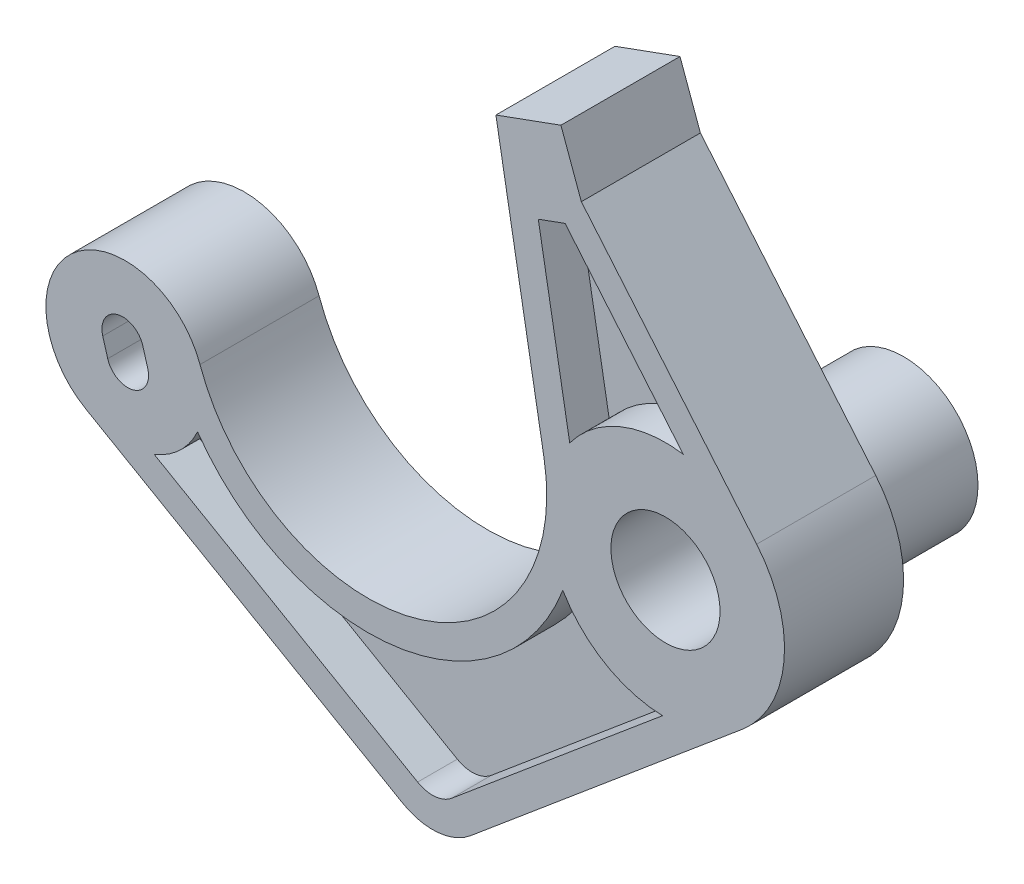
ISO-10303-21;
HEADER;
FILE_DESCRIPTION(('STEP AP214'),'2;1');
FILE_NAME('part.step','',(''),(''),'','','');
FILE_SCHEMA(('AUTOMOTIVE_DESIGN { 1 0 10303 214 1 1 1 1 }'));
ENDSEC;
DATA;
#1=APPLICATION_CONTEXT('core data for automotive mechanical design processes');
#2=APPLICATION_PROTOCOL_DEFINITION('international standard','automotive_design',2000,#1);
#3=PRODUCT_CONTEXT('',#1,'mechanical');
#4=PRODUCT('Part','Part','',(#3));
#5=PRODUCT_RELATED_PRODUCT_CATEGORY('part','',(#4));
#6=PRODUCT_DEFINITION_FORMATION('','',#4);
#7=PRODUCT_DEFINITION_CONTEXT('part definition',#1,'design');
#8=PRODUCT_DEFINITION('design','',#6,#7);
#9=PRODUCT_DEFINITION_SHAPE('','',#8);
#10=(LENGTH_UNIT() NAMED_UNIT(*) SI_UNIT(.MILLI.,.METRE.));
#11=(NAMED_UNIT(*) PLANE_ANGLE_UNIT() SI_UNIT($,.RADIAN.));
#12=(NAMED_UNIT(*) SI_UNIT($,.STERADIAN.) SOLID_ANGLE_UNIT());
#13=UNCERTAINTY_MEASURE_WITH_UNIT(LENGTH_MEASURE(1.E-05),#10,'distance_accuracy_value','');
#14=(GEOMETRIC_REPRESENTATION_CONTEXT(3) GLOBAL_UNCERTAINTY_ASSIGNED_CONTEXT((#13)) GLOBAL_UNIT_ASSIGNED_CONTEXT((#10,
#11,#12)) REPRESENTATION_CONTEXT('',''));
#15=CARTESIAN_POINT('',(0.,0.,0.));
#16=DIRECTION('',(0.,0.,1.));
#17=DIRECTION('',(1.,0.,0.));
#18=AXIS2_PLACEMENT_3D('',#15,#16,#17);
#19=CARTESIAN_POINT('',(27.2255151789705,3.67384921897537,0.));
#20=DIRECTION('',(0.,0.,1.));
#21=DIRECTION('',(1.,0.,0.));
#22=AXIS2_PLACEMENT_3D('',#19,#20,#21);
#23=PLANE('',#22);
#24=DIRECTION('',(0.766044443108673,0.64278760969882,0.));
#25=VECTOR('',#24,1.);
#26=CARTESIAN_POINT('',(17.4125616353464,-12.3926402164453,0.));
#27=LINE('',#26,#25);
#28=CARTESIAN_POINT('',(17.4125616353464,-12.3926402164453,0.));
#29=VERTEX_POINT('',#28);
#30=CARTESIAN_POINT('',(31.0822408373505,-0.92241743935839,0.));
#31=VERTEX_POINT('',#30);
#32=EDGE_CURVE('E519',#29,#31,#27,.T.);
#33=ORIENTED_EDGE('',*,*,#32,.F.);
#34=CARTESIAN_POINT('',(15.4841988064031,-10.0945068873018,0.));
#35=DIRECTION('',(0.,0.,1.));
#36=DIRECTION('',(1.,0.,0.));
#37=AXIS2_PLACEMENT_3D('',#34,#35,#36);
#38=CIRCLE('',#37,2.9999999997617);
#39=CARTESIAN_POINT('',(13.9841988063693,-12.6925830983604,0.));
#40=VERTEX_POINT('',#39);
#41=EDGE_CURVE('E598',#40,#29,#38,.T.);
#42=ORIENTED_EDGE('',*,*,#41,.F.);
#43=DIRECTION('',(0.866025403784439,-0.5,0.));
#44=VECTOR('',#43,1.);
#45=CARTESIAN_POINT('',(-1.99999999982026,-3.46410161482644,0.));
#46=LINE('',#45,#44);
#47=CARTESIAN_POINT('',(-1.99999999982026,-3.46410161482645,0.));
#48=VERTEX_POINT('',#47);
#49=EDGE_CURVE('E653',#48,#40,#46,.T.);
#50=ORIENTED_EDGE('',*,*,#49,.F.);
#51=CARTESIAN_POINT('',(0.,0.,0.));
#52=DIRECTION('',(0.,0.,1.));
#53=DIRECTION('',(1.,0.,0.));
#54=AXIS2_PLACEMENT_3D('',#51,#52,#53);
#55=CIRCLE('',#54,3.99999999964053);
#56=CARTESIAN_POINT('',(3.76673461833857,1.34599788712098,0.));
#57=VERTEX_POINT('',#56);
#58=EDGE_CURVE('E650',#57,#48,#55,.T.);
#59=ORIENTED_EDGE('',*,*,#58,.F.);
#60=CARTESIAN_POINT('',(12.2418875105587,4.37449313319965,0.));
#61=DIRECTION('',(0.,0.,1.));
#62=DIRECTION('',(1.,0.,0.));
#63=AXIS2_PLACEMENT_3D('',#60,#61,#62);
#64=CIRCLE('',#63,9.00000000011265);
#65=CARTESIAN_POINT('',(21.1051572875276,5.93732673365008,0.));
#66=VERTEX_POINT('',#65);
#67=EDGE_CURVE('E646',#57,#66,#64,.T.);
#68=ORIENTED_EDGE('',*,*,#67,.T.);
#69=DIRECTION('',(0.173648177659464,-0.984807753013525,0.));
#70=VECTOR('',#69,1.);
#71=CARTESIAN_POINT('',(18.6797125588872,19.6927073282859,0.));
#72=LINE('',#71,#70);
#73=CARTESIAN_POINT('',(18.6797125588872,19.6927073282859,0.));
#74=VERTEX_POINT('',#73);
#75=EDGE_CURVE('E642',#74,#66,#72,.T.);
#76=ORIENTED_EDGE('',*,*,#75,.F.);
#77=DIRECTION('',(-0.939692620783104,-0.342020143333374,0.));
#78=VECTOR('',#77,1.);
#79=CARTESIAN_POINT('',(21.9571834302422,20.8856091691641,0.));
#80=LINE('',#79,#78);
#81=CARTESIAN_POINT('',(21.9571834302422,20.8856091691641,0.));
#82=VERTEX_POINT('',#81);
#83=EDGE_CURVE('E639',#82,#74,#80,.T.);
#84=ORIENTED_EDGE('',*,*,#83,.F.);
#85=DIRECTION('',(-0.342020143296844,0.9396926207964,0.));
#86=VECTOR('',#85,1.);
#87=CARTESIAN_POINT('',(22.9849132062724,18.0619448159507,0.));
#88=LINE('',#87,#86);
#89=CARTESIAN_POINT('',(22.9849132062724,18.0619448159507,0.));
#90=VERTEX_POINT('',#89);
#91=EDGE_CURVE('E636',#90,#82,#88,.T.);
#92=ORIENTED_EDGE('',*,*,#91,.F.);
#93=DIRECTION('',(-0.642787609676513,0.766044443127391,0.));
#94=VECTOR('',#93,1.);
#95=CARTESIAN_POINT('',(31.8217818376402,7.53057487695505,0.));
#96=LINE('',#95,#94);
#97=CARTESIAN_POINT('',(31.8217818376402,7.53057487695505,0.));
#98=VERTEX_POINT('',#97);
#99=EDGE_CURVE('E633',#98,#90,#96,.T.);
#100=ORIENTED_EDGE('',*,*,#99,.F.);
#101=CARTESIAN_POINT('',(27.2255151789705,3.67384921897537,0.));
#102=DIRECTION('',(0.,0.,1.));
#103=DIRECTION('',(1.,0.,0.));
#104=AXIS2_PLACEMENT_3D('',#101,#102,#103);
#105=CIRCLE('',#104,5.99999999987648);
#106=EDGE_CURVE('E630',#31,#98,#105,.T.);
#107=ORIENTED_EDGE('',*,*,#106,.F.);
#108=EDGE_LOOP('',(#33,#42,#50,#59,#68,#76,#84,#92,#100,#107));
#109=FACE_BOUND('',#108,.T.);
#110=DIRECTION('',(-0.766044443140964,-0.642787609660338,0.));
#111=VECTOR('',#110,1.);
#112=CARTESIAN_POINT('',(16.44838022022,-11.2435735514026,0.));
#113=LINE('',#112,#111);
#114=CARTESIAN_POINT('',(27.0779147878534,-2.32433501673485,0.));
#115=VERTEX_POINT('',#114);
#116=CARTESIAN_POINT('',(16.44838022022,-11.2435735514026,0.));
#117=VERTEX_POINT('',#116);
#118=EDGE_CURVE('E557',#115,#117,#113,.T.);
#119=ORIENTED_EDGE('',*,*,#118,.F.);
#120=CARTESIAN_POINT('',(27.2255151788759,3.67384921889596,0.));
#121=DIRECTION('',(0.,0.,1.));
#122=DIRECTION('',(-1.,0.,0.));
#123=AXIS2_PLACEMENT_3D('',#120,#121,#122);
#124=CIRCLE('',#123,6.);
#125=CARTESIAN_POINT('',(22.052856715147,0.633519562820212,0.));
#126=VERTEX_POINT('',#125);
#127=EDGE_CURVE('E409',#126,#115,#124,.T.);
#128=ORIENTED_EDGE('',*,*,#127,.F.);
#129=CARTESIAN_POINT('',(12.2418875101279,4.37449313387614,0.));
#130=DIRECTION('',(0.,0.,1.));
#131=DIRECTION('',(-1.,0.,0.));
#132=AXIS2_PLACEMENT_3D('',#129,#130,#131);
#133=CIRCLE('',#132,10.5000000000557);
#134=CARTESIAN_POINT('',(3.64317058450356,-1.65145635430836,0.));
#135=VERTEX_POINT('',#134);
#136=EDGE_CURVE('E534',#135,#126,#133,.T.);
#137=ORIENTED_EDGE('',*,*,#136,.F.);
#138=CARTESIAN_POINT('',(2.60735877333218E-10,1.21261334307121E-09,0.));
#139=DIRECTION('',(0.,0.,1.));
#140=DIRECTION('',(-1.,0.,0.));
#141=AXIS2_PLACEMENT_3D('',#138,#139,#140);
#142=CIRCLE('',#141,4.00000000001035);
#143=CARTESIAN_POINT('',(1.45416345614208,-3.72631300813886,0.));
#144=VERTEX_POINT('',#143);
#145=EDGE_CURVE('E569',#144,#135,#142,.T.);
#146=ORIENTED_EDGE('',*,*,#145,.F.);
#147=DIRECTION('',(-0.866025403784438,0.500000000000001,0.));
#148=VECTOR('',#147,1.);
#149=CARTESIAN_POINT('',(1.45416345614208,-3.72631300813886,0.));
#150=LINE('',#149,#148);
#151=CARTESIAN_POINT('',(14.7341988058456,-11.393544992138,0.));
#152=VERTEX_POINT('',#151);
#153=EDGE_CURVE('E565',#152,#144,#150,.T.);
#154=ORIENTED_EDGE('',*,*,#153,.F.);
#155=CARTESIAN_POINT('',(15.4841988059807,-10.0945068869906,0.));
#156=DIRECTION('',(0.,0.,-1.));
#157=DIRECTION('',(-1.,0.,0.));
#158=AXIS2_PLACEMENT_3D('',#155,#156,#157);
#159=CIRCLE('',#158,1.49999999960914);
#160=EDGE_CURVE('E561',#117,#152,#159,.T.);
#161=ORIENTED_EDGE('',*,*,#160,.F.);
#162=EDGE_LOOP('',(#119,#128,#137,#146,#154,#161));
#163=FACE_BOUND('',#162,.T.);
#164=DIRECTION('',(0.642787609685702,-0.766044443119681,0.));
#165=VECTOR('',#164,1.);
#166=CARTESIAN_POINT('',(28.1217309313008,9.60653809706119,0.));
#167=LINE('',#166,#165);
#168=CARTESIAN_POINT('',(22.1656148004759,16.7047608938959,0.));
#169=VERTEX_POINT('',#168);
#170=CARTESIAN_POINT('',(28.1217309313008,9.60653809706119,0.));
#171=VERTEX_POINT('',#170);
#172=EDGE_CURVE('E504',#169,#171,#167,.T.);
#173=ORIENTED_EDGE('',*,*,#172,.F.);
#174=DIRECTION('',(0.939692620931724,0.342020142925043,0.));
#175=VECTOR('',#174,1.);
#176=CARTESIAN_POINT('',(22.1656148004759,16.7047608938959,0.));
#177=LINE('',#176,#175);
#178=CARTESIAN_POINT('',(20.8163038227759,16.213651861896,0.));
#179=VERTEX_POINT('',#178);
#180=EDGE_CURVE('E501',#179,#169,#177,.T.);
#181=ORIENTED_EDGE('',*,*,#180,.F.);
#182=DIRECTION('',(-0.173648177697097,0.984807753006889,0.));
#183=VECTOR('',#182,1.);
#184=CARTESIAN_POINT('',(20.8163038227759,16.213651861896,0.));
#185=LINE('',#184,#183);
#186=CARTESIAN_POINT('',(22.3989308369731,7.23812805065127,0.));
#187=VERTEX_POINT('',#186);
#188=EDGE_CURVE('E488',#187,#179,#185,.T.);
#189=ORIENTED_EDGE('',*,*,#188,.F.);
#190=CARTESIAN_POINT('',(27.2255151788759,3.67384921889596,0.));
#191=DIRECTION('',(0.,0.,1.));
#192=DIRECTION('',(-1.,0.,0.));
#193=AXIS2_PLACEMENT_3D('',#190,#191,#192);
#194=CIRCLE('',#193,6.);
#195=EDGE_CURVE('E509',#171,#187,#194,.T.);
#196=ORIENTED_EDGE('',*,*,#195,.F.);
#197=EDGE_LOOP('',(#173,#181,#189,#196));
#198=FACE_BOUND('',#197,.T.);
#199=CARTESIAN_POINT('',(0.125158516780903,-0.432244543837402,0.));
#200=DIRECTION('',(0.,0.,1.));
#201=DIRECTION('',(1.,0.,0.));
#202=AXIS2_PLACEMENT_3D('',#199,#200,#201);
#203=CIRCLE('',#202,1.05);
#204=CARTESIAN_POINT('',(-0.883412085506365,-0.724281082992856,0.));
#205=VERTEX_POINT('',#204);
#206=CARTESIAN_POINT('',(1.13372911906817,-0.140208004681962,0.));
#207=VERTEX_POINT('',#206);
#208=EDGE_CURVE('E703',#205,#207,#203,.T.);
#209=ORIENTED_EDGE('',*,*,#208,.T.);
#210=DIRECTION('',(-0.278130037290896,0.960543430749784,0.));
#211=VECTOR('',#210,1.);
#212=CARTESIAN_POINT('',(2.13314541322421,-3.59176888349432,0.));
#213=LINE('',#212,#211);
#214=CARTESIAN_POINT('',(0.883412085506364,0.724281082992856,0.));
#215=VERTEX_POINT('',#214);
#216=EDGE_CURVE('E122',#207,#215,#213,.T.);
#217=ORIENTED_EDGE('',*,*,#216,.T.);
#218=CARTESIAN_POINT('',(-0.125158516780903,0.432244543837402,0.));
#219=DIRECTION('',(0.,0.,1.));
#220=DIRECTION('',(1.,0.,0.));
#221=AXIS2_PLACEMENT_3D('',#218,#219,#220);
#222=CIRCLE('',#221,1.05);
#223=CARTESIAN_POINT('',(-1.13372911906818,0.140208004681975,0.));
#224=VERTEX_POINT('',#223);
#225=EDGE_CURVE('E699',#215,#224,#222,.T.);
#226=ORIENTED_EDGE('',*,*,#225,.T.);
#227=DIRECTION('',(0.278130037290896,-0.960543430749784,0.));
#228=VECTOR('',#227,1.);
#229=CARTESIAN_POINT('',(0.116004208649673,-4.1758419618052,0.));
#230=LINE('',#229,#228);
#231=EDGE_CURVE('E695',#224,#205,#230,.T.);
#232=ORIENTED_EDGE('',*,*,#231,.T.);
#233=EDGE_LOOP('',(#209,#217,#226,#232));
#234=FACE_BOUND('',#233,.T.);
#235=CARTESIAN_POINT('',(27.2255151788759,3.67384921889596,0.));
#236=DIRECTION('',(0.,0.,1.));
#237=DIRECTION('',(1.,0.,0.));
#238=AXIS2_PLACEMENT_3D('',#235,#236,#237);
#239=CIRCLE('',#238,3.75);
#240=CARTESIAN_POINT('',(30.9755151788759,3.67384921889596,0.));
#241=VERTEX_POINT('',#240);
#242=EDGE_CURVE('E13',#241,#241,#239,.F.);
#243=ORIENTED_EDGE('',*,*,#242,.F.);
#244=EDGE_LOOP('',(#243));
#245=FACE_BOUND('',#244,.T.);
#246=ADVANCED_FACE('F113',(#109,#163,#198,#234,#245),#23,.F.);
#247=CARTESIAN_POINT('',(27.2255151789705,3.67384921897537,6.));
#248=DIRECTION('',(0.,0.,1.));
#249=DIRECTION('',(1.,0.,0.));
#250=AXIS2_PLACEMENT_3D('',#247,#248,#249);
#251=PLANE('',#250);
#252=CARTESIAN_POINT('',(27.2255151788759,3.67384921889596,6.));
#253=DIRECTION('',(0.,0.,1.));
#254=DIRECTION('',(1.,0.,0.));
#255=AXIS2_PLACEMENT_3D('',#252,#253,#254);
#256=CIRCLE('',#255,2.75);
#257=CARTESIAN_POINT('',(29.9755151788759,3.67384921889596,6.));
#258=VERTEX_POINT('',#257);
#259=EDGE_CURVE('E362',#258,#258,#256,.T.);
#260=ORIENTED_EDGE('',*,*,#259,.F.);
#261=EDGE_LOOP('',(#260));
#262=FACE_BOUND('',#261,.T.);
#263=CARTESIAN_POINT('',(27.2255151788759,3.67384921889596,6.));
#264=DIRECTION('',(0.,0.,-1.));
#265=DIRECTION('',(1.,0.,0.));
#266=AXIS2_PLACEMENT_3D('',#263,#264,#265);
#267=CIRCLE('',#266,6.);
#268=CARTESIAN_POINT('',(22.3989308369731,7.23812805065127,6.));
#269=VERTEX_POINT('',#268);
#270=CARTESIAN_POINT('',(28.1217309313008,9.60653809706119,6.));
#271=VERTEX_POINT('',#270);
#272=EDGE_CURVE('E391',#269,#271,#267,.T.);
#273=ORIENTED_EDGE('',*,*,#272,.F.);
#274=DIRECTION('',(0.173648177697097,-0.984807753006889,0.));
#275=VECTOR('',#274,1.);
#276=CARTESIAN_POINT('',(20.8163038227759,16.213651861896,6.));
#277=LINE('',#276,#275);
#278=CARTESIAN_POINT('',(20.8163038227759,16.213651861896,6.));
#279=VERTEX_POINT('',#278);
#280=EDGE_CURVE('E378',#279,#269,#277,.T.);
#281=ORIENTED_EDGE('',*,*,#280,.F.);
#282=DIRECTION('',(-0.939692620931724,-0.342020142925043,0.));
#283=VECTOR('',#282,1.);
#284=CARTESIAN_POINT('',(22.1656148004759,16.7047608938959,6.));
#285=LINE('',#284,#283);
#286=CARTESIAN_POINT('',(22.1656148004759,16.7047608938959,6.));
#287=VERTEX_POINT('',#286);
#288=EDGE_CURVE('E399',#287,#279,#285,.T.);
#289=ORIENTED_EDGE('',*,*,#288,.F.);
#290=DIRECTION('',(-0.642787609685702,0.766044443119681,0.));
#291=VECTOR('',#290,1.);
#292=CARTESIAN_POINT('',(28.1217309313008,9.60653809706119,6.));
#293=LINE('',#292,#291);
#294=EDGE_CURVE('E394',#271,#287,#293,.T.);
#295=ORIENTED_EDGE('',*,*,#294,.F.);
#296=EDGE_LOOP('',(#273,#281,#289,#295));
#297=FACE_BOUND('',#296,.T.);
#298=CARTESIAN_POINT('',(15.4841988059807,-10.0945068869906,6.));
#299=DIRECTION('',(0.,0.,1.));
#300=DIRECTION('',(1.,0.,0.));
#301=AXIS2_PLACEMENT_3D('',#298,#299,#300);
#302=CIRCLE('',#301,1.49999999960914);
#303=CARTESIAN_POINT('',(14.7341988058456,-11.393544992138,6.));
#304=VERTEX_POINT('',#303);
#305=CARTESIAN_POINT('',(16.44838022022,-11.2435735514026,6.));
#306=VERTEX_POINT('',#305);
#307=EDGE_CURVE('E372',#304,#306,#302,.T.);
#308=ORIENTED_EDGE('',*,*,#307,.F.);
#309=DIRECTION('',(0.866025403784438,-0.500000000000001,0.));
#310=VECTOR('',#309,1.);
#311=CARTESIAN_POINT('',(1.45416345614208,-3.72631300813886,6.));
#312=LINE('',#311,#310);
#313=CARTESIAN_POINT('',(1.45416345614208,-3.72631300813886,6.));
#314=VERTEX_POINT('',#313);
#315=EDGE_CURVE('E424',#314,#304,#312,.T.);
#316=ORIENTED_EDGE('',*,*,#315,.F.);
#317=CARTESIAN_POINT('',(2.60735877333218E-10,1.21261334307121E-09,6.));
#318=DIRECTION('',(0.,0.,-1.));
#319=DIRECTION('',(1.,0.,0.));
#320=AXIS2_PLACEMENT_3D('',#317,#318,#319);
#321=CIRCLE('',#320,4.00000000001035);
#322=CARTESIAN_POINT('',(3.64317058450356,-1.65145635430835,6.));
#323=VERTEX_POINT('',#322);
#324=EDGE_CURVE('E459',#323,#314,#321,.T.);
#325=ORIENTED_EDGE('',*,*,#324,.F.);
#326=CARTESIAN_POINT('',(12.2418875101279,4.37449313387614,6.));
#327=DIRECTION('',(0.,0.,-1.));
#328=DIRECTION('',(1.,0.,0.));
#329=AXIS2_PLACEMENT_3D('',#326,#327,#328);
#330=CIRCLE('',#329,10.5000000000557);
#331=CARTESIAN_POINT('',(22.052856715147,0.633519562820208,6.));
#332=VERTEX_POINT('',#331);
#333=EDGE_CURVE('E455',#332,#323,#330,.T.);
#334=ORIENTED_EDGE('',*,*,#333,.F.);
#335=CARTESIAN_POINT('',(27.2255151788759,3.67384921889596,6.));
#336=DIRECTION('',(0.,0.,-1.));
#337=DIRECTION('',(1.,0.,0.));
#338=AXIS2_PLACEMENT_3D('',#335,#336,#337);
#339=CIRCLE('',#338,6.);
#340=CARTESIAN_POINT('',(27.0779147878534,-2.32433501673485,6.));
#341=VERTEX_POINT('',#340);
#342=EDGE_CURVE('E451',#341,#332,#339,.T.);
#343=ORIENTED_EDGE('',*,*,#342,.F.);
#344=DIRECTION('',(0.766044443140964,0.642787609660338,0.));
#345=VECTOR('',#344,1.);
#346=CARTESIAN_POINT('',(16.44838022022,-11.2435735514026,6.));
#347=LINE('',#346,#345);
#348=EDGE_CURVE('E447',#306,#341,#347,.T.);
#349=ORIENTED_EDGE('',*,*,#348,.F.);
#350=EDGE_LOOP('',(#308,#316,#325,#334,#343,#349));
#351=FACE_BOUND('',#350,.T.);
#352=DIRECTION('',(0.766044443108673,0.64278760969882,0.));
#353=VECTOR('',#352,1.);
#354=CARTESIAN_POINT('',(17.4125616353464,-12.3926402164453,6.));
#355=LINE('',#354,#353);
#356=CARTESIAN_POINT('',(17.4125616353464,-12.3926402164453,6.));
#357=VERTEX_POINT('',#356);
#358=CARTESIAN_POINT('',(31.0822408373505,-0.92241743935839,6.));
#359=VERTEX_POINT('',#358);
#360=EDGE_CURVE('E593',#357,#359,#355,.T.);
#361=ORIENTED_EDGE('',*,*,#360,.T.);
#362=CARTESIAN_POINT('',(27.2255151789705,3.67384921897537,6.));
#363=DIRECTION('',(0.,0.,1.));
#364=DIRECTION('',(1.,0.,0.));
#365=AXIS2_PLACEMENT_3D('',#362,#363,#364);
#366=CIRCLE('',#365,5.99999999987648);
#367=CARTESIAN_POINT('',(31.8217818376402,7.53057487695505,6.));
#368=VERTEX_POINT('',#367);
#369=EDGE_CURVE('E597',#359,#368,#366,.T.);
#370=ORIENTED_EDGE('',*,*,#369,.T.);
#371=DIRECTION('',(-0.642787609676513,0.766044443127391,0.));
#372=VECTOR('',#371,1.);
#373=CARTESIAN_POINT('',(31.8217818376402,7.53057487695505,6.));
#374=LINE('',#373,#372);
#375=CARTESIAN_POINT('',(22.9849132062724,18.0619448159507,6.));
#376=VERTEX_POINT('',#375);
#377=EDGE_CURVE('E601',#368,#376,#374,.T.);
#378=ORIENTED_EDGE('',*,*,#377,.T.);
#379=DIRECTION('',(-0.342020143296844,0.9396926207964,0.));
#380=VECTOR('',#379,1.);
#381=CARTESIAN_POINT('',(22.9849132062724,18.0619448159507,6.));
#382=LINE('',#381,#380);
#383=CARTESIAN_POINT('',(21.9571834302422,20.8856091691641,6.));
#384=VERTEX_POINT('',#383);
#385=EDGE_CURVE('E604',#376,#384,#382,.T.);
#386=ORIENTED_EDGE('',*,*,#385,.T.);
#387=DIRECTION('',(-0.939692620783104,-0.342020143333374,0.));
#388=VECTOR('',#387,1.);
#389=CARTESIAN_POINT('',(21.9571834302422,20.8856091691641,6.));
#390=LINE('',#389,#388);
#391=CARTESIAN_POINT('',(18.6797125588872,19.6927073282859,6.));
#392=VERTEX_POINT('',#391);
#393=EDGE_CURVE('E607',#384,#392,#390,.T.);
#394=ORIENTED_EDGE('',*,*,#393,.T.);
#395=DIRECTION('',(0.173648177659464,-0.984807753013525,0.));
#396=VECTOR('',#395,1.);
#397=CARTESIAN_POINT('',(18.6797125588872,19.6927073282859,6.));
#398=LINE('',#397,#396);
#399=CARTESIAN_POINT('',(21.1051572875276,5.93732673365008,6.));
#400=VERTEX_POINT('',#399);
#401=EDGE_CURVE('E610',#392,#400,#398,.T.);
#402=ORIENTED_EDGE('',*,*,#401,.T.);
#403=CARTESIAN_POINT('',(12.2418875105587,4.37449313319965,6.));
#404=DIRECTION('',(0.,0.,1.));
#405=DIRECTION('',(1.,0.,0.));
#406=AXIS2_PLACEMENT_3D('',#403,#404,#405);
#407=CIRCLE('',#406,9.00000000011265);
#408=CARTESIAN_POINT('',(3.76673461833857,1.34599788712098,6.));
#409=VERTEX_POINT('',#408);
#410=EDGE_CURVE('E613',#409,#400,#407,.T.);
#411=ORIENTED_EDGE('',*,*,#410,.F.);
#412=CARTESIAN_POINT('',(0.,0.,6.));
#413=DIRECTION('',(0.,0.,1.));
#414=DIRECTION('',(1.,0.,0.));
#415=AXIS2_PLACEMENT_3D('',#412,#413,#414);
#416=CIRCLE('',#415,3.99999999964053);
#417=CARTESIAN_POINT('',(-1.99999999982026,-3.46410161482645,6.));
#418=VERTEX_POINT('',#417);
#419=EDGE_CURVE('E617',#409,#418,#416,.T.);
#420=ORIENTED_EDGE('',*,*,#419,.T.);
#421=DIRECTION('',(0.866025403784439,-0.5,0.));
#422=VECTOR('',#421,1.);
#423=CARTESIAN_POINT('',(-1.99999999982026,-3.46410161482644,6.));
#424=LINE('',#423,#422);
#425=CARTESIAN_POINT('',(13.9841988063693,-12.6925830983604,6.));
#426=VERTEX_POINT('',#425);
#427=EDGE_CURVE('E620',#418,#426,#424,.T.);
#428=ORIENTED_EDGE('',*,*,#427,.T.);
#429=CARTESIAN_POINT('',(15.4841988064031,-10.0945068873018,6.));
#430=DIRECTION('',(0.,0.,1.));
#431=DIRECTION('',(1.,0.,0.));
#432=AXIS2_PLACEMENT_3D('',#429,#430,#431);
#433=CIRCLE('',#432,2.9999999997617);
#434=EDGE_CURVE('E623',#426,#357,#433,.T.);
#435=ORIENTED_EDGE('',*,*,#434,.T.);
#436=EDGE_LOOP('',(#361,#370,#378,#386,#394,#402,#411,#420,#428,#435));
#437=FACE_BOUND('',#436,.T.);
#438=CARTESIAN_POINT('',(-0.125158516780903,0.432244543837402,6.));
#439=DIRECTION('',(0.,0.,1.));
#440=DIRECTION('',(1.,0.,0.));
#441=AXIS2_PLACEMENT_3D('',#438,#439,#440);
#442=CIRCLE('',#441,1.05);
#443=CARTESIAN_POINT('',(0.883412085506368,0.724281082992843,6.));
#444=VERTEX_POINT('',#443);
#445=CARTESIAN_POINT('',(-1.13372911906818,0.140208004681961,6.));
#446=VERTEX_POINT('',#445);
#447=EDGE_CURVE('E354',#444,#446,#442,.T.);
#448=ORIENTED_EDGE('',*,*,#447,.F.);
#449=DIRECTION('',(0.278130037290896,-0.960543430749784,0.));
#450=VECTOR('',#449,1.);
#451=CARTESIAN_POINT('',(0.883412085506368,0.724281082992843,6.));
#452=LINE('',#451,#450);
#453=CARTESIAN_POINT('',(1.13372911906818,-0.140208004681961,6.));
#454=VERTEX_POINT('',#453);
#455=EDGE_CURVE('E339',#444,#454,#452,.T.);
#456=ORIENTED_EDGE('',*,*,#455,.T.);
#457=CARTESIAN_POINT('',(0.125158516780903,-0.432244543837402,6.));
#458=DIRECTION('',(0.,0.,1.));
#459=DIRECTION('',(1.,0.,0.));
#460=AXIS2_PLACEMENT_3D('',#457,#458,#459);
#461=CIRCLE('',#460,1.05);
#462=CARTESIAN_POINT('',(-0.883412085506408,-0.724281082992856,6.));
#463=VERTEX_POINT('',#462);
#464=EDGE_CURVE('E345',#463,#454,#461,.T.);
#465=ORIENTED_EDGE('',*,*,#464,.F.);
#466=DIRECTION('',(0.278130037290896,-0.960543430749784,0.));
#467=VECTOR('',#466,1.);
#468=CARTESIAN_POINT('',(-1.13372911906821,0.140208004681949,6.));
#469=LINE('',#468,#467);
#470=EDGE_CURVE('E356',#446,#463,#469,.T.);
#471=ORIENTED_EDGE('',*,*,#470,.F.);
#472=EDGE_LOOP('',(#448,#456,#465,#471));
#473=FACE_BOUND('',#472,.T.);
#474=ADVANCED_FACE('F353',(#262,#297,#351,#437,#473),#251,.T.);
#475=CARTESIAN_POINT('',(17.4125616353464,-12.3926402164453,6.));
#476=DIRECTION('',(-0.642787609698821,0.766044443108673,0.));
#477=DIRECTION('',(-0.766044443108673,-0.642787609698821,0.));
#478=AXIS2_PLACEMENT_3D('',#475,#476,#477);
#479=PLANE('',#478);
#480=ORIENTED_EDGE('',*,*,#32,.T.);
#481=DIRECTION('',(0.,0.,-1.));
#482=VECTOR('',#481,1.);
#483=CARTESIAN_POINT('',(31.0822408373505,-0.92241743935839,6.));
#484=LINE('',#483,#482);
#485=EDGE_CURVE('E691',#359,#31,#484,.T.);
#486=ORIENTED_EDGE('',*,*,#485,.F.);
#487=ORIENTED_EDGE('',*,*,#360,.F.);
#488=DIRECTION('',(0.,0.,-1.));
#489=VECTOR('',#488,1.);
#490=CARTESIAN_POINT('',(17.4125616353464,-12.3926402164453,6.));
#491=LINE('',#490,#489);
#492=EDGE_CURVE('E626',#357,#29,#491,.T.);
#493=ORIENTED_EDGE('',*,*,#492,.T.);
#494=EDGE_LOOP('',(#480,#486,#487,#493));
#495=FACE_BOUND('',#494,.T.);
#496=ADVANCED_FACE('F115',(#495),#479,.F.);
#497=CARTESIAN_POINT('',(27.2255151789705,3.67384921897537,6.));
#498=DIRECTION('',(0.,0.,-1.));
#499=DIRECTION('',(-1.,0.,0.));
#500=AXIS2_PLACEMENT_3D('',#497,#498,#499);
#501=CYLINDRICAL_SURFACE('',#500,5.99999999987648);
#502=ORIENTED_EDGE('',*,*,#106,.T.);
#503=DIRECTION('',(0.,0.,-1.));
#504=VECTOR('',#503,1.);
#505=CARTESIAN_POINT('',(31.8217818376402,7.53057487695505,6.));
#506=LINE('',#505,#504);
#507=EDGE_CURVE('E687',#368,#98,#506,.T.);
#508=ORIENTED_EDGE('',*,*,#507,.F.);
#509=ORIENTED_EDGE('',*,*,#369,.F.);
#510=ORIENTED_EDGE('',*,*,#485,.T.);
#511=EDGE_LOOP('',(#502,#508,#509,#510));
#512=FACE_BOUND('',#511,.T.);
#513=ADVANCED_FACE('F765',(#512),#501,.T.);
#514=CARTESIAN_POINT('',(31.8217818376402,7.53057487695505,6.));
#515=DIRECTION('',(-0.766044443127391,-0.642787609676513,0.));
#516=DIRECTION('',(0.642787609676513,-0.766044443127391,0.));
#517=AXIS2_PLACEMENT_3D('',#514,#515,#516);
#518=PLANE('',#517);
#519=ORIENTED_EDGE('',*,*,#99,.T.);
#520=DIRECTION('',(0.,0.,-1.));
#521=VECTOR('',#520,1.);
#522=CARTESIAN_POINT('',(22.9849132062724,18.0619448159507,6.));
#523=LINE('',#522,#521);
#524=EDGE_CURVE('E683',#376,#90,#523,.T.);
#525=ORIENTED_EDGE('',*,*,#524,.F.);
#526=ORIENTED_EDGE('',*,*,#377,.F.);
#527=ORIENTED_EDGE('',*,*,#507,.T.);
#528=EDGE_LOOP('',(#519,#525,#526,#527));
#529=FACE_BOUND('',#528,.T.);
#530=ADVANCED_FACE('F762',(#529),#518,.F.);
#531=CARTESIAN_POINT('',(22.9849132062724,18.0619448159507,6.));
#532=DIRECTION('',(-0.9396926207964,-0.342020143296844,0.));
#533=DIRECTION('',(0.342020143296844,-0.9396926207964,0.));
#534=AXIS2_PLACEMENT_3D('',#531,#532,#533);
#535=PLANE('',#534);
#536=ORIENTED_EDGE('',*,*,#91,.T.);
#537=DIRECTION('',(0.,0.,-1.));
#538=VECTOR('',#537,1.);
#539=CARTESIAN_POINT('',(21.9571834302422,20.8856091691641,6.));
#540=LINE('',#539,#538);
#541=EDGE_CURVE('E679',#384,#82,#540,.T.);
#542=ORIENTED_EDGE('',*,*,#541,.F.);
#543=ORIENTED_EDGE('',*,*,#385,.F.);
#544=ORIENTED_EDGE('',*,*,#524,.T.);
#545=EDGE_LOOP('',(#536,#542,#543,#544));
#546=FACE_BOUND('',#545,.T.);
#547=ADVANCED_FACE('F758',(#546),#535,.F.);
#548=CARTESIAN_POINT('',(21.9571834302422,20.8856091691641,6.));
#549=DIRECTION('',(0.342020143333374,-0.939692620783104,0.));
#550=DIRECTION('',(0.939692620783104,0.342020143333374,0.));
#551=AXIS2_PLACEMENT_3D('',#548,#549,#550);
#552=PLANE('',#551);
#553=ORIENTED_EDGE('',*,*,#83,.T.);
#554=DIRECTION('',(0.,0.,-1.));
#555=VECTOR('',#554,1.);
#556=CARTESIAN_POINT('',(18.6797125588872,19.6927073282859,6.));
#557=LINE('',#556,#555);
#558=EDGE_CURVE('E675',#392,#74,#557,.T.);
#559=ORIENTED_EDGE('',*,*,#558,.F.);
#560=ORIENTED_EDGE('',*,*,#393,.F.);
#561=ORIENTED_EDGE('',*,*,#541,.T.);
#562=EDGE_LOOP('',(#553,#559,#560,#561));
#563=FACE_BOUND('',#562,.T.);
#564=ADVANCED_FACE('F754',(#563),#552,.F.);
#565=CARTESIAN_POINT('',(18.6797125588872,19.6927073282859,6.));
#566=DIRECTION('',(0.984807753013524,0.173648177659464,0.));
#567=DIRECTION('',(-0.173648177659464,0.984807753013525,0.));
#568=AXIS2_PLACEMENT_3D('',#565,#566,#567);
#569=PLANE('',#568);
#570=ORIENTED_EDGE('',*,*,#75,.T.);
#571=DIRECTION('',(0.,0.,-1.));
#572=VECTOR('',#571,1.);
#573=CARTESIAN_POINT('',(21.1051572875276,5.93732673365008,6.));
#574=LINE('',#573,#572);
#575=EDGE_CURVE('E672',#400,#66,#574,.T.);
#576=ORIENTED_EDGE('',*,*,#575,.F.);
#577=ORIENTED_EDGE('',*,*,#401,.F.);
#578=ORIENTED_EDGE('',*,*,#558,.T.);
#579=EDGE_LOOP('',(#570,#576,#577,#578));
#580=FACE_BOUND('',#579,.T.);
#581=ADVANCED_FACE('F750',(#580),#569,.F.);
#582=CARTESIAN_POINT('',(12.2418875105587,4.37449313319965,6.));
#583=DIRECTION('',(0.,0.,-1.));
#584=DIRECTION('',(-1.,0.,0.));
#585=AXIS2_PLACEMENT_3D('',#582,#583,#584);
#586=CYLINDRICAL_SURFACE('',#585,9.00000000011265);
#587=ORIENTED_EDGE('',*,*,#67,.F.);
#588=DIRECTION('',(0.,0.,-1.));
#589=VECTOR('',#588,1.);
#590=CARTESIAN_POINT('',(3.76673461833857,1.34599788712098,6.));
#591=LINE('',#590,#589);
#592=EDGE_CURVE('E669',#409,#57,#591,.T.);
#593=ORIENTED_EDGE('',*,*,#592,.F.);
#594=ORIENTED_EDGE('',*,*,#410,.T.);
#595=ORIENTED_EDGE('',*,*,#575,.T.);
#596=EDGE_LOOP('',(#587,#593,#594,#595));
#597=FACE_BOUND('',#596,.T.);
#598=ADVANCED_FACE('F746',(#597),#586,.F.);
#599=CARTESIAN_POINT('',(0.,0.,6.));
#600=DIRECTION('',(0.,0.,-1.));
#601=DIRECTION('',(-1.,0.,0.));
#602=AXIS2_PLACEMENT_3D('',#599,#600,#601);
#603=CYLINDRICAL_SURFACE('',#602,3.99999999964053);
#604=ORIENTED_EDGE('',*,*,#58,.T.);
#605=DIRECTION('',(0.,0.,-1.));
#606=VECTOR('',#605,1.);
#607=CARTESIAN_POINT('',(-1.99999999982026,-3.46410161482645,6.));
#608=LINE('',#607,#606);
#609=EDGE_CURVE('E665',#418,#48,#608,.T.);
#610=ORIENTED_EDGE('',*,*,#609,.F.);
#611=ORIENTED_EDGE('',*,*,#419,.F.);
#612=ORIENTED_EDGE('',*,*,#592,.T.);
#613=EDGE_LOOP('',(#604,#610,#611,#612));
#614=FACE_BOUND('',#613,.T.);
#615=ADVANCED_FACE('F742',(#614),#603,.T.);
#616=CARTESIAN_POINT('',(-1.99999999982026,-3.46410161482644,6.));
#617=DIRECTION('',(0.5,0.866025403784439,0.));
#618=DIRECTION('',(-0.866025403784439,0.5,0.));
#619=AXIS2_PLACEMENT_3D('',#616,#617,#618);
#620=PLANE('',#619);
#621=ORIENTED_EDGE('',*,*,#49,.T.);
#622=DIRECTION('',(0.,0.,-1.));
#623=VECTOR('',#622,1.);
#624=CARTESIAN_POINT('',(13.9841988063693,-12.6925830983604,6.));
#625=LINE('',#624,#623);
#626=EDGE_CURVE('E661',#426,#40,#625,.T.);
#627=ORIENTED_EDGE('',*,*,#626,.F.);
#628=ORIENTED_EDGE('',*,*,#427,.F.);
#629=ORIENTED_EDGE('',*,*,#609,.T.);
#630=EDGE_LOOP('',(#621,#627,#628,#629));
#631=FACE_BOUND('',#630,.T.);
#632=ADVANCED_FACE('F738',(#631),#620,.F.);
#633=CARTESIAN_POINT('',(15.4841988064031,-10.0945068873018,6.));
#634=DIRECTION('',(0.,0.,-1.));
#635=DIRECTION('',(-1.,0.,0.));
#636=AXIS2_PLACEMENT_3D('',#633,#634,#635);
#637=CYLINDRICAL_SURFACE('',#636,2.9999999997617);
#638=ORIENTED_EDGE('',*,*,#41,.T.);
#639=ORIENTED_EDGE('',*,*,#492,.F.);
#640=ORIENTED_EDGE('',*,*,#434,.F.);
#641=ORIENTED_EDGE('',*,*,#626,.T.);
#642=EDGE_LOOP('',(#638,#639,#640,#641));
#643=FACE_BOUND('',#642,.T.);
#644=ADVANCED_FACE('F734',(#643),#637,.T.);
#645=CARTESIAN_POINT('',(27.2255151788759,3.67384921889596,2.));
#646=DIRECTION('',(0.,0.,-1.));
#647=DIRECTION('',(-1.,0.,0.));
#648=AXIS2_PLACEMENT_3D('',#645,#646,#647);
#649=CYLINDRICAL_SURFACE('',#648,6.);
#650=ORIENTED_EDGE('',*,*,#127,.T.);
#651=DIRECTION('',(0.,0.,-1.));
#652=VECTOR('',#651,1.);
#653=CARTESIAN_POINT('',(27.0779147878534,-2.32433501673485,2.));
#654=LINE('',#653,#652);
#655=CARTESIAN_POINT('',(27.0779147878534,-2.32433501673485,2.));
#656=VERTEX_POINT('',#655);
#657=EDGE_CURVE('E554',#656,#115,#654,.T.);
#658=ORIENTED_EDGE('',*,*,#657,.F.);
#659=CARTESIAN_POINT('',(27.2255151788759,3.67384921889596,2.));
#660=DIRECTION('',(0.,0.,1.));
#661=DIRECTION('',(-1.,0.,0.));
#662=AXIS2_PLACEMENT_3D('',#659,#660,#661);
#663=CIRCLE('',#662,6.);
#664=CARTESIAN_POINT('',(22.052856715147,0.633519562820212,2.));
#665=VERTEX_POINT('',#664);
#666=EDGE_CURVE('E529',#665,#656,#663,.T.);
#667=ORIENTED_EDGE('',*,*,#666,.F.);
#668=DIRECTION('',(0.,0.,-1.));
#669=VECTOR('',#668,1.);
#670=CARTESIAN_POINT('',(22.052856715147,0.633519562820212,2.));
#671=LINE('',#670,#669);
#672=EDGE_CURVE('E505',#665,#126,#671,.T.);
#673=ORIENTED_EDGE('',*,*,#672,.T.);
#674=EDGE_LOOP('',(#650,#658,#667,#673));
#675=FACE_BOUND('',#674,.T.);
#676=ADVANCED_FACE('F737',(#675),#649,.T.);
#677=CARTESIAN_POINT('',(12.2418875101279,4.37449313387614,2.));
#678=DIRECTION('',(0.,0.,-1.));
#679=DIRECTION('',(-1.,0.,0.));
#680=AXIS2_PLACEMENT_3D('',#677,#678,#679);
#681=CYLINDRICAL_SURFACE('',#680,10.5000000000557);
#682=ORIENTED_EDGE('',*,*,#136,.T.);
#683=ORIENTED_EDGE('',*,*,#672,.F.);
#684=CARTESIAN_POINT('',(12.2418875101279,4.37449313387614,2.));
#685=DIRECTION('',(0.,0.,1.));
#686=DIRECTION('',(-1.,0.,0.));
#687=AXIS2_PLACEMENT_3D('',#684,#685,#686);
#688=CIRCLE('',#687,10.5000000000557);
#689=CARTESIAN_POINT('',(3.64317058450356,-1.65145635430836,2.));
#690=VERTEX_POINT('',#689);
#691=EDGE_CURVE('E550',#690,#665,#688,.T.);
#692=ORIENTED_EDGE('',*,*,#691,.F.);
#693=DIRECTION('',(0.,0.,-1.));
#694=VECTOR('',#693,1.);
#695=CARTESIAN_POINT('',(3.64317058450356,-1.65145635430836,2.));
#696=LINE('',#695,#694);
#697=EDGE_CURVE('E578',#690,#135,#696,.T.);
#698=ORIENTED_EDGE('',*,*,#697,.T.);
#699=EDGE_LOOP('',(#682,#683,#692,#698));
#700=FACE_BOUND('',#699,.T.);
#701=ADVANCED_FACE('F1051',(#700),#681,.T.);
#702=CARTESIAN_POINT('',(2.60735877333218E-10,1.21261334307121E-09,2.));
#703=DIRECTION('',(0.,0.,-1.));
#704=DIRECTION('',(-1.,0.,0.));
#705=AXIS2_PLACEMENT_3D('',#702,#703,#704);
#706=CYLINDRICAL_SURFACE('',#705,4.00000000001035);
#707=ORIENTED_EDGE('',*,*,#145,.T.);
#708=ORIENTED_EDGE('',*,*,#697,.F.);
#709=CARTESIAN_POINT('',(2.60735877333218E-10,1.21261334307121E-09,2.));
#710=DIRECTION('',(0.,0.,1.));
#711=DIRECTION('',(-1.,0.,0.));
#712=AXIS2_PLACEMENT_3D('',#709,#710,#711);
#713=CIRCLE('',#712,4.00000000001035);
#714=CARTESIAN_POINT('',(1.45416345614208,-3.72631300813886,2.));
#715=VERTEX_POINT('',#714);
#716=EDGE_CURVE('E546',#715,#690,#713,.T.);
#717=ORIENTED_EDGE('',*,*,#716,.F.);
#718=DIRECTION('',(0.,0.,-1.));
#719=VECTOR('',#718,1.);
#720=CARTESIAN_POINT('',(1.45416345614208,-3.72631300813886,2.));
#721=LINE('',#720,#719);
#722=EDGE_CURVE('E581',#715,#144,#721,.T.);
#723=ORIENTED_EDGE('',*,*,#722,.T.);
#724=EDGE_LOOP('',(#707,#708,#717,#723));
#725=FACE_BOUND('',#724,.T.);
#726=ADVANCED_FACE('F1041',(#725),#706,.T.);
#727=CARTESIAN_POINT('',(1.45416345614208,-3.72631300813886,2.));
#728=DIRECTION('',(-0.500000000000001,-0.866025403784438,0.));
#729=DIRECTION('',(0.866025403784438,-0.500000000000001,0.));
#730=AXIS2_PLACEMENT_3D('',#727,#728,#729);
#731=PLANE('',#730);
#732=ORIENTED_EDGE('',*,*,#153,.T.);
#733=ORIENTED_EDGE('',*,*,#722,.F.);
#734=DIRECTION('',(-0.866025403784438,0.500000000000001,0.));
#735=VECTOR('',#734,1.);
#736=CARTESIAN_POINT('',(1.45416345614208,-3.72631300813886,2.));
#737=LINE('',#736,#735);
#738=CARTESIAN_POINT('',(14.7341988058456,-11.393544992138,2.));
#739=VERTEX_POINT('',#738);
#740=EDGE_CURVE('E542',#739,#715,#737,.T.);
#741=ORIENTED_EDGE('',*,*,#740,.F.);
#742=DIRECTION('',(0.,0.,-1.));
#743=VECTOR('',#742,1.);
#744=CARTESIAN_POINT('',(14.7341988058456,-11.393544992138,2.));
#745=LINE('',#744,#743);
#746=EDGE_CURVE('E584',#739,#152,#745,.T.);
#747=ORIENTED_EDGE('',*,*,#746,.T.);
#748=EDGE_LOOP('',(#732,#733,#741,#747));
#749=FACE_BOUND('',#748,.T.);
#750=ADVANCED_FACE('F1031',(#749),#731,.F.);
#751=CARTESIAN_POINT('',(15.4841988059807,-10.0945068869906,2.));
#752=DIRECTION('',(0.,0.,-1.));
#753=DIRECTION('',(-1.,0.,0.));
#754=AXIS2_PLACEMENT_3D('',#751,#752,#753);
#755=CYLINDRICAL_SURFACE('',#754,1.49999999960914);
#756=ORIENTED_EDGE('',*,*,#160,.T.);
#757=ORIENTED_EDGE('',*,*,#746,.F.);
#758=CARTESIAN_POINT('',(15.4841988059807,-10.0945068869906,2.));
#759=DIRECTION('',(0.,0.,-1.));
#760=DIRECTION('',(-1.,0.,0.));
#761=AXIS2_PLACEMENT_3D('',#758,#759,#760);
#762=CIRCLE('',#761,1.49999999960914);
#763=CARTESIAN_POINT('',(16.44838022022,-11.2435735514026,2.));
#764=VERTEX_POINT('',#763);
#765=EDGE_CURVE('E538',#764,#739,#762,.T.);
#766=ORIENTED_EDGE('',*,*,#765,.F.);
#767=DIRECTION('',(0.,0.,-1.));
#768=VECTOR('',#767,1.);
#769=CARTESIAN_POINT('',(16.44838022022,-11.2435735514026,2.));
#770=LINE('',#769,#768);
#771=EDGE_CURVE('E587',#764,#117,#770,.T.);
#772=ORIENTED_EDGE('',*,*,#771,.T.);
#773=EDGE_LOOP('',(#756,#757,#766,#772));
#774=FACE_BOUND('',#773,.T.);
#775=ADVANCED_FACE('F1021',(#774),#755,.F.);
#776=CARTESIAN_POINT('',(16.44838022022,-11.2435735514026,2.));
#777=DIRECTION('',(0.642787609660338,-0.766044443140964,0.));
#778=DIRECTION('',(0.766044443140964,0.642787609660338,0.));
#779=AXIS2_PLACEMENT_3D('',#776,#777,#778);
#780=PLANE('',#779);
#781=ORIENTED_EDGE('',*,*,#118,.T.);
#782=ORIENTED_EDGE('',*,*,#771,.F.);
#783=DIRECTION('',(-0.766044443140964,-0.642787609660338,0.));
#784=VECTOR('',#783,1.);
#785=CARTESIAN_POINT('',(16.44838022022,-11.2435735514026,2.));
#786=LINE('',#785,#784);
#787=EDGE_CURVE('E533',#656,#764,#786,.T.);
#788=ORIENTED_EDGE('',*,*,#787,.F.);
#789=ORIENTED_EDGE('',*,*,#657,.T.);
#790=EDGE_LOOP('',(#781,#782,#788,#789));
#791=FACE_BOUND('',#790,.T.);
#792=ADVANCED_FACE('F1011',(#791),#780,.F.);
#793=CARTESIAN_POINT('',(27.2255151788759,3.67384921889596,2.));
#794=DIRECTION('',(0.,0.,-1.));
#795=DIRECTION('',(-1.,0.,0.));
#796=AXIS2_PLACEMENT_3D('',#793,#794,#795);
#797=PLANE('',#796);
#798=ORIENTED_EDGE('',*,*,#666,.T.);
#799=ORIENTED_EDGE('',*,*,#787,.T.);
#800=ORIENTED_EDGE('',*,*,#765,.T.);
#801=ORIENTED_EDGE('',*,*,#740,.T.);
#802=ORIENTED_EDGE('',*,*,#716,.T.);
#803=ORIENTED_EDGE('',*,*,#691,.T.);
#804=EDGE_LOOP('',(#798,#799,#800,#801,#802,#803));
#805=FACE_BOUND('',#804,.T.);
#806=ADVANCED_FACE('F1001',(#805),#797,.T.);
#807=CARTESIAN_POINT('',(22.1656148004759,16.7047608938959,2.));
#808=DIRECTION('',(-0.342020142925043,0.939692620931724,0.));
#809=DIRECTION('',(-0.939692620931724,-0.342020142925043,0.));
#810=AXIS2_PLACEMENT_3D('',#807,#808,#809);
#811=PLANE('',#810);
#812=ORIENTED_EDGE('',*,*,#180,.T.);
#813=DIRECTION('',(0.,0.,-1.));
#814=VECTOR('',#813,1.);
#815=CARTESIAN_POINT('',(22.1656148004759,16.7047608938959,2.));
#816=LINE('',#815,#814);
#817=CARTESIAN_POINT('',(22.1656148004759,16.7047608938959,2.));
#818=VERTEX_POINT('',#817);
#819=EDGE_CURVE('E500',#818,#169,#816,.T.);
#820=ORIENTED_EDGE('',*,*,#819,.F.);
#821=DIRECTION('',(0.939692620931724,0.342020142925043,0.));
#822=VECTOR('',#821,1.);
#823=CARTESIAN_POINT('',(22.1656148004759,16.7047608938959,2.));
#824=LINE('',#823,#822);
#825=CARTESIAN_POINT('',(20.8163038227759,16.213651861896,2.));
#826=VERTEX_POINT('',#825);
#827=EDGE_CURVE('E483',#826,#818,#824,.T.);
#828=ORIENTED_EDGE('',*,*,#827,.F.);
#829=DIRECTION('',(0.,0.,-1.));
#830=VECTOR('',#829,1.);
#831=CARTESIAN_POINT('',(20.8163038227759,16.213651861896,2.));
#832=LINE('',#831,#830);
#833=EDGE_CURVE('E516',#826,#179,#832,.T.);
#834=ORIENTED_EDGE('',*,*,#833,.T.);
#835=EDGE_LOOP('',(#812,#820,#828,#834));
#836=FACE_BOUND('',#835,.T.);
#837=ADVANCED_FACE('F991',(#836),#811,.F.);
#838=CARTESIAN_POINT('',(20.8163038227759,16.213651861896,2.));
#839=DIRECTION('',(-0.984807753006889,-0.173648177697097,0.));
#840=DIRECTION('',(0.173648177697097,-0.984807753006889,0.));
#841=AXIS2_PLACEMENT_3D('',#838,#839,#840);
#842=PLANE('',#841);
#843=ORIENTED_EDGE('',*,*,#188,.T.);
#844=ORIENTED_EDGE('',*,*,#833,.F.);
#845=DIRECTION('',(-0.173648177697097,0.984807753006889,0.));
#846=VECTOR('',#845,1.);
#847=CARTESIAN_POINT('',(20.8163038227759,16.213651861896,2.));
#848=LINE('',#847,#846);
#849=CARTESIAN_POINT('',(22.3989308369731,7.23812805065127,2.));
#850=VERTEX_POINT('',#849);
#851=EDGE_CURVE('E496',#850,#826,#848,.T.);
#852=ORIENTED_EDGE('',*,*,#851,.F.);
#853=DIRECTION('',(0.,0.,-1.));
#854=VECTOR('',#853,1.);
#855=CARTESIAN_POINT('',(22.3989308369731,7.23812805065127,2.));
#856=LINE('',#855,#854);
#857=EDGE_CURVE('E520',#850,#187,#856,.T.);
#858=ORIENTED_EDGE('',*,*,#857,.T.);
#859=EDGE_LOOP('',(#843,#844,#852,#858));
#860=FACE_BOUND('',#859,.T.);
#861=ADVANCED_FACE('F981',(#860),#842,.F.);
#862=CARTESIAN_POINT('',(27.2255151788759,3.67384921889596,2.));
#863=DIRECTION('',(0.,0.,-1.));
#864=DIRECTION('',(-1.,0.,0.));
#865=AXIS2_PLACEMENT_3D('',#862,#863,#864);
#866=CYLINDRICAL_SURFACE('',#865,6.);
#867=ORIENTED_EDGE('',*,*,#195,.T.);
#868=ORIENTED_EDGE('',*,*,#857,.F.);
#869=CARTESIAN_POINT('',(27.2255151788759,3.67384921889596,2.));
#870=DIRECTION('',(0.,0.,1.));
#871=DIRECTION('',(-1.,0.,0.));
#872=AXIS2_PLACEMENT_3D('',#869,#870,#871);
#873=CIRCLE('',#872,6.);
#874=CARTESIAN_POINT('',(28.1217309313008,9.60653809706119,2.));
#875=VERTEX_POINT('',#874);
#876=EDGE_CURVE('E492',#875,#850,#873,.T.);
#877=ORIENTED_EDGE('',*,*,#876,.F.);
#878=DIRECTION('',(0.,0.,-1.));
#879=VECTOR('',#878,1.);
#880=CARTESIAN_POINT('',(28.1217309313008,9.60653809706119,2.));
#881=LINE('',#880,#879);
#882=EDGE_CURVE('E523',#875,#171,#881,.T.);
#883=ORIENTED_EDGE('',*,*,#882,.T.);
#884=EDGE_LOOP('',(#867,#868,#877,#883));
#885=FACE_BOUND('',#884,.T.);
#886=ADVANCED_FACE('F971',(#885),#866,.T.);
#887=CARTESIAN_POINT('',(28.1217309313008,9.60653809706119,2.));
#888=DIRECTION('',(0.766044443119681,0.642787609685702,0.));
#889=DIRECTION('',(-0.642787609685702,0.766044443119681,0.));
#890=AXIS2_PLACEMENT_3D('',#887,#888,#889);
#891=PLANE('',#890);
#892=ORIENTED_EDGE('',*,*,#172,.T.);
#893=ORIENTED_EDGE('',*,*,#882,.F.);
#894=DIRECTION('',(0.642787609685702,-0.766044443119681,0.));
#895=VECTOR('',#894,1.);
#896=CARTESIAN_POINT('',(28.1217309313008,9.60653809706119,2.));
#897=LINE('',#896,#895);
#898=EDGE_CURVE('E487',#818,#875,#897,.T.);
#899=ORIENTED_EDGE('',*,*,#898,.F.);
#900=ORIENTED_EDGE('',*,*,#819,.T.);
#901=EDGE_LOOP('',(#892,#893,#899,#900));
#902=FACE_BOUND('',#901,.T.);
#903=ADVANCED_FACE('F961',(#902),#891,.F.);
#904=CARTESIAN_POINT('',(27.2255151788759,3.67384921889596,2.));
#905=DIRECTION('',(0.,0.,-1.));
#906=DIRECTION('',(-1.,0.,0.));
#907=AXIS2_PLACEMENT_3D('',#904,#905,#906);
#908=PLANE('',#907);
#909=ORIENTED_EDGE('',*,*,#827,.T.);
#910=ORIENTED_EDGE('',*,*,#898,.T.);
#911=ORIENTED_EDGE('',*,*,#876,.T.);
#912=ORIENTED_EDGE('',*,*,#851,.T.);
#913=EDGE_LOOP('',(#909,#910,#911,#912));
#914=FACE_BOUND('',#913,.T.);
#915=ADVANCED_FACE('F951',(#914),#908,.T.);
#916=CARTESIAN_POINT('',(15.4841988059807,-10.0945068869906,4.));
#917=DIRECTION('',(0.,0.,1.));
#918=DIRECTION('',(1.,0.,0.));
#919=AXIS2_PLACEMENT_3D('',#916,#917,#918);
#920=CYLINDRICAL_SURFACE('',#919,1.49999999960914);
#921=ORIENTED_EDGE('',*,*,#307,.T.);
#922=DIRECTION('',(0.,0.,1.));
#923=VECTOR('',#922,1.);
#924=CARTESIAN_POINT('',(16.44838022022,-11.2435735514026,4.));
#925=LINE('',#924,#923);
#926=CARTESIAN_POINT('',(16.44838022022,-11.2435735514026,4.));
#927=VERTEX_POINT('',#926);
#928=EDGE_CURVE('E444',#927,#306,#925,.T.);
#929=ORIENTED_EDGE('',*,*,#928,.F.);
#930=CARTESIAN_POINT('',(15.4841988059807,-10.0945068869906,4.));
#931=DIRECTION('',(0.,0.,1.));
#932=DIRECTION('',(1.,0.,0.));
#933=AXIS2_PLACEMENT_3D('',#930,#931,#932);
#934=CIRCLE('',#933,1.49999999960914);
#935=CARTESIAN_POINT('',(14.7341988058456,-11.393544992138,4.));
#936=VERTEX_POINT('',#935);
#937=EDGE_CURVE('E419',#936,#927,#934,.T.);
#938=ORIENTED_EDGE('',*,*,#937,.F.);
#939=DIRECTION('',(0.,0.,1.));
#940=VECTOR('',#939,1.);
#941=CARTESIAN_POINT('',(14.7341988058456,-11.393544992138,4.));
#942=LINE('',#941,#940);
#943=EDGE_CURVE('E395',#936,#304,#942,.T.);
#944=ORIENTED_EDGE('',*,*,#943,.T.);
#945=EDGE_LOOP('',(#921,#929,#938,#944));
#946=FACE_BOUND('',#945,.T.);
#947=ADVANCED_FACE('F941',(#946),#920,.F.);
#948=CARTESIAN_POINT('',(1.45416345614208,-3.72631300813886,4.));
#949=DIRECTION('',(-0.500000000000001,-0.866025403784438,0.));
#950=DIRECTION('',(0.866025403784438,-0.500000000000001,0.));
#951=AXIS2_PLACEMENT_3D('',#948,#949,#950);
#952=PLANE('',#951);
#953=ORIENTED_EDGE('',*,*,#315,.T.);
#954=ORIENTED_EDGE('',*,*,#943,.F.);
#955=DIRECTION('',(0.866025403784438,-0.500000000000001,0.));
#956=VECTOR('',#955,1.);
#957=CARTESIAN_POINT('',(1.45416345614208,-3.72631300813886,4.));
#958=LINE('',#957,#956);
#959=CARTESIAN_POINT('',(1.45416345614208,-3.72631300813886,4.));
#960=VERTEX_POINT('',#959);
#961=EDGE_CURVE('E440',#960,#936,#958,.T.);
#962=ORIENTED_EDGE('',*,*,#961,.F.);
#963=DIRECTION('',(0.,0.,1.));
#964=VECTOR('',#963,1.);
#965=CARTESIAN_POINT('',(1.45416345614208,-3.72631300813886,4.));
#966=LINE('',#965,#964);
#967=EDGE_CURVE('E468',#960,#314,#966,.T.);
#968=ORIENTED_EDGE('',*,*,#967,.T.);
#969=EDGE_LOOP('',(#953,#954,#962,#968));
#970=FACE_BOUND('',#969,.T.);
#971=ADVANCED_FACE('F931',(#970),#952,.F.);
#972=CARTESIAN_POINT('',(2.60735877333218E-10,1.21261334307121E-09,4.));
#973=DIRECTION('',(0.,0.,1.));
#974=DIRECTION('',(1.,0.,0.));
#975=AXIS2_PLACEMENT_3D('',#972,#973,#974);
#976=CYLINDRICAL_SURFACE('',#975,4.00000000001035);
#977=ORIENTED_EDGE('',*,*,#324,.T.);
#978=ORIENTED_EDGE('',*,*,#967,.F.);
#979=CARTESIAN_POINT('',(2.60735877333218E-10,1.21261334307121E-09,4.));
#980=DIRECTION('',(0.,0.,-1.));
#981=DIRECTION('',(1.,0.,0.));
#982=AXIS2_PLACEMENT_3D('',#979,#980,#981);
#983=CIRCLE('',#982,4.00000000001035);
#984=CARTESIAN_POINT('',(3.64317058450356,-1.65145635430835,4.));
#985=VERTEX_POINT('',#984);
#986=EDGE_CURVE('E436',#985,#960,#983,.T.);
#987=ORIENTED_EDGE('',*,*,#986,.F.);
#988=DIRECTION('',(0.,0.,1.));
#989=VECTOR('',#988,1.);
#990=CARTESIAN_POINT('',(3.64317058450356,-1.65145635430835,4.));
#991=LINE('',#990,#989);
#992=EDGE_CURVE('E471',#985,#323,#991,.T.);
#993=ORIENTED_EDGE('',*,*,#992,.T.);
#994=EDGE_LOOP('',(#977,#978,#987,#993));
#995=FACE_BOUND('',#994,.T.);
#996=ADVANCED_FACE('F921',(#995),#976,.T.);
#997=CARTESIAN_POINT('',(12.2418875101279,4.37449313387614,4.));
#998=DIRECTION('',(0.,0.,1.));
#999=DIRECTION('',(1.,0.,0.));
#1000=AXIS2_PLACEMENT_3D('',#997,#998,#999);
#1001=CYLINDRICAL_SURFACE('',#1000,10.5000000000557);
#1002=ORIENTED_EDGE('',*,*,#333,.T.);
#1003=ORIENTED_EDGE('',*,*,#992,.F.);
#1004=CARTESIAN_POINT('',(12.2418875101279,4.37449313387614,4.));
#1005=DIRECTION('',(0.,0.,-1.));
#1006=DIRECTION('',(1.,0.,0.));
#1007=AXIS2_PLACEMENT_3D('',#1004,#1005,#1006);
#1008=CIRCLE('',#1007,10.5000000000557);
#1009=CARTESIAN_POINT('',(22.052856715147,0.633519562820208,4.));
#1010=VERTEX_POINT('',#1009);
#1011=EDGE_CURVE('E432',#1010,#985,#1008,.T.);
#1012=ORIENTED_EDGE('',*,*,#1011,.F.);
#1013=DIRECTION('',(0.,0.,1.));
#1014=VECTOR('',#1013,1.);
#1015=CARTESIAN_POINT('',(22.052856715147,0.633519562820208,4.));
#1016=LINE('',#1015,#1014);
#1017=EDGE_CURVE('E474',#1010,#332,#1016,.T.);
#1018=ORIENTED_EDGE('',*,*,#1017,.T.);
#1019=EDGE_LOOP('',(#1002,#1003,#1012,#1018));
#1020=FACE_BOUND('',#1019,.T.);
#1021=ADVANCED_FACE('F911',(#1020),#1001,.T.);
#1022=CARTESIAN_POINT('',(27.2255151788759,3.67384921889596,4.));
#1023=DIRECTION('',(0.,0.,1.));
#1024=DIRECTION('',(1.,0.,0.));
#1025=AXIS2_PLACEMENT_3D('',#1022,#1023,#1024);
#1026=CYLINDRICAL_SURFACE('',#1025,6.);
#1027=ORIENTED_EDGE('',*,*,#342,.T.);
#1028=ORIENTED_EDGE('',*,*,#1017,.F.);
#1029=CARTESIAN_POINT('',(27.2255151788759,3.67384921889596,4.));
#1030=DIRECTION('',(0.,0.,-1.));
#1031=DIRECTION('',(1.,0.,0.));
#1032=AXIS2_PLACEMENT_3D('',#1029,#1030,#1031);
#1033=CIRCLE('',#1032,6.);
#1034=CARTESIAN_POINT('',(27.0779147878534,-2.32433501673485,4.));
#1035=VERTEX_POINT('',#1034);
#1036=EDGE_CURVE('E428',#1035,#1010,#1033,.T.);
#1037=ORIENTED_EDGE('',*,*,#1036,.F.);
#1038=DIRECTION('',(0.,0.,1.));
#1039=VECTOR('',#1038,1.);
#1040=CARTESIAN_POINT('',(27.0779147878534,-2.32433501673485,4.));
#1041=LINE('',#1040,#1039);
#1042=EDGE_CURVE('E477',#1035,#341,#1041,.T.);
#1043=ORIENTED_EDGE('',*,*,#1042,.T.);
#1044=EDGE_LOOP('',(#1027,#1028,#1037,#1043));
#1045=FACE_BOUND('',#1044,.T.);
#1046=ADVANCED_FACE('F901',(#1045),#1026,.T.);
#1047=CARTESIAN_POINT('',(16.44838022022,-11.2435735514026,4.));
#1048=DIRECTION('',(0.642787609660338,-0.766044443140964,0.));
#1049=DIRECTION('',(0.766044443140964,0.642787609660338,0.));
#1050=AXIS2_PLACEMENT_3D('',#1047,#1048,#1049);
#1051=PLANE('',#1050);
#1052=ORIENTED_EDGE('',*,*,#348,.T.);
#1053=ORIENTED_EDGE('',*,*,#1042,.F.);
#1054=DIRECTION('',(0.766044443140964,0.642787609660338,0.));
#1055=VECTOR('',#1054,1.);
#1056=CARTESIAN_POINT('',(16.44838022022,-11.2435735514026,4.));
#1057=LINE('',#1056,#1055);
#1058=EDGE_CURVE('E423',#927,#1035,#1057,.T.);
#1059=ORIENTED_EDGE('',*,*,#1058,.F.);
#1060=ORIENTED_EDGE('',*,*,#928,.T.);
#1061=EDGE_LOOP('',(#1052,#1053,#1059,#1060));
#1062=FACE_BOUND('',#1061,.T.);
#1063=ADVANCED_FACE('F891',(#1062),#1051,.F.);
#1064=CARTESIAN_POINT('',(15.4841988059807,-10.0945068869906,4.));
#1065=DIRECTION('',(0.,0.,1.));
#1066=DIRECTION('',(1.,0.,0.));
#1067=AXIS2_PLACEMENT_3D('',#1064,#1065,#1066);
#1068=PLANE('',#1067);
#1069=ORIENTED_EDGE('',*,*,#937,.T.);
#1070=ORIENTED_EDGE('',*,*,#1058,.T.);
#1071=ORIENTED_EDGE('',*,*,#1036,.T.);
#1072=ORIENTED_EDGE('',*,*,#1011,.T.);
#1073=ORIENTED_EDGE('',*,*,#986,.T.);
#1074=ORIENTED_EDGE('',*,*,#961,.T.);
#1075=EDGE_LOOP('',(#1069,#1070,#1071,#1072,#1073,#1074));
#1076=FACE_BOUND('',#1075,.T.);
#1077=ADVANCED_FACE('F881',(#1076),#1068,.T.);
#1078=CARTESIAN_POINT('',(27.2255151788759,3.67384921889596,4.));
#1079=DIRECTION('',(0.,0.,1.));
#1080=DIRECTION('',(1.,0.,0.));
#1081=AXIS2_PLACEMENT_3D('',#1078,#1079,#1080);
#1082=CYLINDRICAL_SURFACE('',#1081,6.);
#1083=ORIENTED_EDGE('',*,*,#272,.T.);
#1084=DIRECTION('',(0.,0.,1.));
#1085=VECTOR('',#1084,1.);
#1086=CARTESIAN_POINT('',(28.1217309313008,9.60653809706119,4.));
#1087=LINE('',#1086,#1085);
#1088=CARTESIAN_POINT('',(28.1217309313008,9.60653809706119,4.));
#1089=VERTEX_POINT('',#1088);
#1090=EDGE_CURVE('E390',#1089,#271,#1087,.T.);
#1091=ORIENTED_EDGE('',*,*,#1090,.F.);
#1092=CARTESIAN_POINT('',(27.2255151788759,3.67384921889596,4.));
#1093=DIRECTION('',(0.,0.,-1.));
#1094=DIRECTION('',(1.,0.,0.));
#1095=AXIS2_PLACEMENT_3D('',#1092,#1093,#1094);
#1096=CIRCLE('',#1095,6.);
#1097=CARTESIAN_POINT('',(22.3989308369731,7.23812805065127,4.));
#1098=VERTEX_POINT('',#1097);
#1099=EDGE_CURVE('E373',#1098,#1089,#1096,.T.);
#1100=ORIENTED_EDGE('',*,*,#1099,.F.);
#1101=DIRECTION('',(0.,0.,1.));
#1102=VECTOR('',#1101,1.);
#1103=CARTESIAN_POINT('',(22.3989308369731,7.23812805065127,4.));
#1104=LINE('',#1103,#1102);
#1105=EDGE_CURVE('E406',#1098,#269,#1104,.T.);
#1106=ORIENTED_EDGE('',*,*,#1105,.T.);
#1107=EDGE_LOOP('',(#1083,#1091,#1100,#1106));
#1108=FACE_BOUND('',#1107,.T.);
#1109=ADVANCED_FACE('F871',(#1108),#1082,.T.);
#1110=CARTESIAN_POINT('',(20.8163038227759,16.213651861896,4.));
#1111=DIRECTION('',(-0.984807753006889,-0.173648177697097,0.));
#1112=DIRECTION('',(0.173648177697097,-0.984807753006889,0.));
#1113=AXIS2_PLACEMENT_3D('',#1110,#1111,#1112);
#1114=PLANE('',#1113);
#1115=ORIENTED_EDGE('',*,*,#280,.T.);
#1116=ORIENTED_EDGE('',*,*,#1105,.F.);
#1117=DIRECTION('',(0.173648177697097,-0.984807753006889,0.));
#1118=VECTOR('',#1117,1.);
#1119=CARTESIAN_POINT('',(20.8163038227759,16.213651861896,4.));
#1120=LINE('',#1119,#1118);
#1121=CARTESIAN_POINT('',(20.8163038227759,16.213651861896,4.));
#1122=VERTEX_POINT('',#1121);
#1123=EDGE_CURVE('E386',#1122,#1098,#1120,.T.);
#1124=ORIENTED_EDGE('',*,*,#1123,.F.);
#1125=DIRECTION('',(0.,0.,1.));
#1126=VECTOR('',#1125,1.);
#1127=CARTESIAN_POINT('',(20.8163038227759,16.213651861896,4.));
#1128=LINE('',#1127,#1126);
#1129=EDGE_CURVE('E410',#1122,#279,#1128,.T.);
#1130=ORIENTED_EDGE('',*,*,#1129,.T.);
#1131=EDGE_LOOP('',(#1115,#1116,#1124,#1130));
#1132=FACE_BOUND('',#1131,.T.);
#1133=ADVANCED_FACE('F861',(#1132),#1114,.F.);
#1134=CARTESIAN_POINT('',(22.1656148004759,16.7047608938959,4.));
#1135=DIRECTION('',(-0.342020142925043,0.939692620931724,0.));
#1136=DIRECTION('',(-0.939692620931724,-0.342020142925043,0.));
#1137=AXIS2_PLACEMENT_3D('',#1134,#1135,#1136);
#1138=PLANE('',#1137);
#1139=ORIENTED_EDGE('',*,*,#288,.T.);
#1140=ORIENTED_EDGE('',*,*,#1129,.F.);
#1141=DIRECTION('',(-0.939692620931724,-0.342020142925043,0.));
#1142=VECTOR('',#1141,1.);
#1143=CARTESIAN_POINT('',(22.1656148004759,16.7047608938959,4.));
#1144=LINE('',#1143,#1142);
#1145=CARTESIAN_POINT('',(22.1656148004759,16.7047608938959,4.));
#1146=VERTEX_POINT('',#1145);
#1147=EDGE_CURVE('E382',#1146,#1122,#1144,.T.);
#1148=ORIENTED_EDGE('',*,*,#1147,.F.);
#1149=DIRECTION('',(0.,0.,1.));
#1150=VECTOR('',#1149,1.);
#1151=CARTESIAN_POINT('',(22.1656148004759,16.7047608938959,4.));
#1152=LINE('',#1151,#1150);
#1153=EDGE_CURVE('E413',#1146,#287,#1152,.T.);
#1154=ORIENTED_EDGE('',*,*,#1153,.T.);
#1155=EDGE_LOOP('',(#1139,#1140,#1148,#1154));
#1156=FACE_BOUND('',#1155,.T.);
#1157=ADVANCED_FACE('F851',(#1156),#1138,.F.);
#1158=CARTESIAN_POINT('',(28.1217309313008,9.60653809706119,4.));
#1159=DIRECTION('',(0.766044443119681,0.642787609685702,0.));
#1160=DIRECTION('',(-0.642787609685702,0.766044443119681,0.));
#1161=AXIS2_PLACEMENT_3D('',#1158,#1159,#1160);
#1162=PLANE('',#1161);
#1163=ORIENTED_EDGE('',*,*,#294,.T.);
#1164=ORIENTED_EDGE('',*,*,#1153,.F.);
#1165=DIRECTION('',(-0.642787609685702,0.766044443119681,0.));
#1166=VECTOR('',#1165,1.);
#1167=CARTESIAN_POINT('',(28.1217309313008,9.60653809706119,4.));
#1168=LINE('',#1167,#1166);
#1169=EDGE_CURVE('E377',#1089,#1146,#1168,.T.);
#1170=ORIENTED_EDGE('',*,*,#1169,.F.);
#1171=ORIENTED_EDGE('',*,*,#1090,.T.);
#1172=EDGE_LOOP('',(#1163,#1164,#1170,#1171));
#1173=FACE_BOUND('',#1172,.T.);
#1174=ADVANCED_FACE('F841',(#1173),#1162,.F.);
#1175=CARTESIAN_POINT('',(27.2255151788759,3.67384921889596,4.));
#1176=DIRECTION('',(0.,0.,1.));
#1177=DIRECTION('',(1.,0.,0.));
#1178=AXIS2_PLACEMENT_3D('',#1175,#1176,#1177);
#1179=PLANE('',#1178);
#1180=ORIENTED_EDGE('',*,*,#1099,.T.);
#1181=ORIENTED_EDGE('',*,*,#1169,.T.);
#1182=ORIENTED_EDGE('',*,*,#1147,.T.);
#1183=ORIENTED_EDGE('',*,*,#1123,.T.);
#1184=EDGE_LOOP('',(#1180,#1181,#1182,#1183));
#1185=FACE_BOUND('',#1184,.T.);
#1186=ADVANCED_FACE('F718',(#1185),#1179,.T.);
#1187=CARTESIAN_POINT('',(0.125158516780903,-0.432244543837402,6.));
#1188=DIRECTION('',(0.,0.,1.));
#1189=DIRECTION('',(1.,0.,0.));
#1190=AXIS2_PLACEMENT_3D('',#1187,#1188,#1189);
#1191=CYLINDRICAL_SURFACE('',#1190,1.05);
#1192=DIRECTION('',(0.,0.,1.));
#1193=VECTOR('',#1192,1.);
#1194=CARTESIAN_POINT('',(-0.883412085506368,-0.724281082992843,6.));
#1195=LINE('',#1194,#1193);
#1196=EDGE_CURVE('E129',#463,#205,#1195,.F.);
#1197=ORIENTED_EDGE('',*,*,#1196,.F.);
#1198=ORIENTED_EDGE('',*,*,#464,.T.);
#1199=DIRECTION('',(0.,0.,1.));
#1200=VECTOR('',#1199,1.);
#1201=CARTESIAN_POINT('',(1.13372911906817,-0.140208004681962,6.));
#1202=LINE('',#1201,#1200);
#1203=EDGE_CURVE('E335',#207,#454,#1202,.T.);
#1204=ORIENTED_EDGE('',*,*,#1203,.F.);
#1205=ORIENTED_EDGE('',*,*,#208,.F.);
#1206=EDGE_LOOP('',(#1197,#1198,#1204,#1205));
#1207=FACE_BOUND('',#1206,.T.);
#1208=ADVANCED_FACE('F348',(#1207),#1191,.F.);
#1209=CARTESIAN_POINT('',(-0.125158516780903,0.432244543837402,6.));
#1210=DIRECTION('',(0.,0.,1.));
#1211=DIRECTION('',(1.,0.,0.));
#1212=AXIS2_PLACEMENT_3D('',#1209,#1210,#1211);
#1213=CYLINDRICAL_SURFACE('',#1212,1.05);
#1214=DIRECTION('',(0.,0.,1.));
#1215=VECTOR('',#1214,1.);
#1216=CARTESIAN_POINT('',(0.883412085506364,0.724281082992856,6.));
#1217=LINE('',#1216,#1215);
#1218=EDGE_CURVE('E137',#444,#215,#1217,.F.);
#1219=ORIENTED_EDGE('',*,*,#1218,.F.);
#1220=ORIENTED_EDGE('',*,*,#447,.T.);
#1221=DIRECTION('',(0.,0.,1.));
#1222=VECTOR('',#1221,1.);
#1223=CARTESIAN_POINT('',(-1.13372911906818,0.140208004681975,6.));
#1224=LINE('',#1223,#1222);
#1225=EDGE_CURVE('E360',#224,#446,#1224,.T.);
#1226=ORIENTED_EDGE('',*,*,#1225,.F.);
#1227=ORIENTED_EDGE('',*,*,#225,.F.);
#1228=EDGE_LOOP('',(#1219,#1220,#1226,#1227));
#1229=FACE_BOUND('',#1228,.T.);
#1230=ADVANCED_FACE('F710',(#1229),#1213,.F.);
#1231=CARTESIAN_POINT('',(0.883412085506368,0.724281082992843,6.));
#1232=DIRECTION('',(0.960543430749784,0.278130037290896,0.));
#1233=DIRECTION('',(-0.278130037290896,0.960543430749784,0.));
#1234=AXIS2_PLACEMENT_3D('',#1231,#1232,#1233);
#1235=PLANE('',#1234);
#1236=ORIENTED_EDGE('',*,*,#1203,.T.);
#1237=ORIENTED_EDGE('',*,*,#455,.F.);
#1238=ORIENTED_EDGE('',*,*,#1218,.T.);
#1239=ORIENTED_EDGE('',*,*,#216,.F.);
#1240=EDGE_LOOP('',(#1236,#1237,#1238,#1239));
#1241=FACE_BOUND('',#1240,.T.);
#1242=ADVANCED_FACE('F337',(#1241),#1235,.F.);
#1243=CARTESIAN_POINT('',(-1.13372911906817,0.140208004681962,6.));
#1244=DIRECTION('',(-0.960543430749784,-0.278130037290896,0.));
#1245=DIRECTION('',(0.278130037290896,-0.960543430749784,0.));
#1246=AXIS2_PLACEMENT_3D('',#1243,#1244,#1245);
#1247=PLANE('',#1246);
#1248=ORIENTED_EDGE('',*,*,#1225,.T.);
#1249=ORIENTED_EDGE('',*,*,#470,.T.);
#1250=ORIENTED_EDGE('',*,*,#1196,.T.);
#1251=ORIENTED_EDGE('',*,*,#231,.F.);
#1252=EDGE_LOOP('',(#1248,#1249,#1250,#1251));
#1253=FACE_BOUND('',#1252,.T.);
#1254=ADVANCED_FACE('F709',(#1253),#1247,.F.);
#1255=CARTESIAN_POINT('',(27.2255151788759,3.67384921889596,-8.));
#1256=DIRECTION('',(0.,0.,1.));
#1257=DIRECTION('',(1.,0.,0.));
#1258=AXIS2_PLACEMENT_3D('',#1255,#1256,#1257);
#1259=CYLINDRICAL_SURFACE('',#1258,2.75);
#1260=ORIENTED_EDGE('',*,*,#259,.T.);
#1261=EDGE_LOOP('',(#1260));
#1262=FACE_BOUND('',#1261,.T.);
#1263=CARTESIAN_POINT('',(27.2255151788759,3.67384921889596,-6.));
#1264=DIRECTION('',(0.,0.,-1.));
#1265=DIRECTION('',(-1.,0.,0.));
#1266=AXIS2_PLACEMENT_3D('',#1263,#1264,#1265);
#1267=CIRCLE('',#1266,2.75);
#1268=CARTESIAN_POINT('',(24.4755151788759,3.67384921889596,-6.));
#1269=VERTEX_POINT('',#1268);
#1270=EDGE_CURVE('E1209',#1269,#1269,#1267,.T.);
#1271=ORIENTED_EDGE('',*,*,#1270,.T.);
#1272=EDGE_LOOP('',(#1271));
#1273=FACE_BOUND('',#1272,.T.);
#1274=ADVANCED_FACE('F816',(#1262,#1273),#1259,.F.);
#1275=CARTESIAN_POINT('',(27.2255151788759,3.67384921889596,-6.));
#1276=DIRECTION('',(0.,0.,-1.));
#1277=DIRECTION('',(-1.,0.,0.));
#1278=AXIS2_PLACEMENT_3D('',#1275,#1276,#1277);
#1279=PLANE('',#1278);
#1280=CARTESIAN_POINT('',(27.2255151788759,3.67384921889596,-6.));
#1281=DIRECTION('',(0.,0.,-1.));
#1282=DIRECTION('',(-1.,0.,0.));
#1283=AXIS2_PLACEMENT_3D('',#1280,#1281,#1282);
#1284=CIRCLE('',#1283,3.75);
#1285=CARTESIAN_POINT('',(23.4755151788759,3.67384921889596,-6.));
#1286=VERTEX_POINT('',#1285);
#1287=EDGE_CURVE('E1206',#1286,#1286,#1284,.T.);
#1288=ORIENTED_EDGE('',*,*,#1287,.T.);
#1289=EDGE_LOOP('',(#1288));
#1290=FACE_BOUND('',#1289,.T.);
#1291=ORIENTED_EDGE('',*,*,#1270,.F.);
#1292=EDGE_LOOP('',(#1291));
#1293=FACE_BOUND('',#1292,.T.);
#1294=ADVANCED_FACE('F1177',(#1290,#1293),#1279,.T.);
#1295=CARTESIAN_POINT('',(27.2255151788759,3.67384921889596,-6.));
#1296=DIRECTION('',(0.,0.,1.));
#1297=DIRECTION('',(1.,0.,0.));
#1298=AXIS2_PLACEMENT_3D('',#1295,#1296,#1297);
#1299=CYLINDRICAL_SURFACE('',#1298,3.75);
#1300=ORIENTED_EDGE('',*,*,#1287,.F.);
#1301=EDGE_LOOP('',(#1300));
#1302=FACE_BOUND('',#1301,.T.);
#1303=ORIENTED_EDGE('',*,*,#242,.T.);
#1304=EDGE_LOOP('',(#1303));
#1305=FACE_BOUND('',#1304,.T.);
#1306=ADVANCED_FACE('F1184',(#1302,#1305),#1299,.T.);
#1307=CLOSED_SHELL('',(#246,#474,#496,#513,#530,#547,#564,#581,#598,#615,#632,#644,#676,#701,
#726,#750,#775,#792,#806,#837,#861,#886,#903,#915,#947,#971,#996,#1021,#1046,#1063,#1077,#1109,
#1133,#1157,#1174,#1186,#1208,#1230,#1242,#1254,#1274,#1294,#1306));
#1308=MANIFOLD_SOLID_BREP('B2',#1307);
#1309=ADVANCED_BREP_SHAPE_REPRESENTATION('',(#18,#1308),#14);
#1310=SHAPE_DEFINITION_REPRESENTATION(#9,#1309);
ENDSEC;
END-ISO-10303-21;
